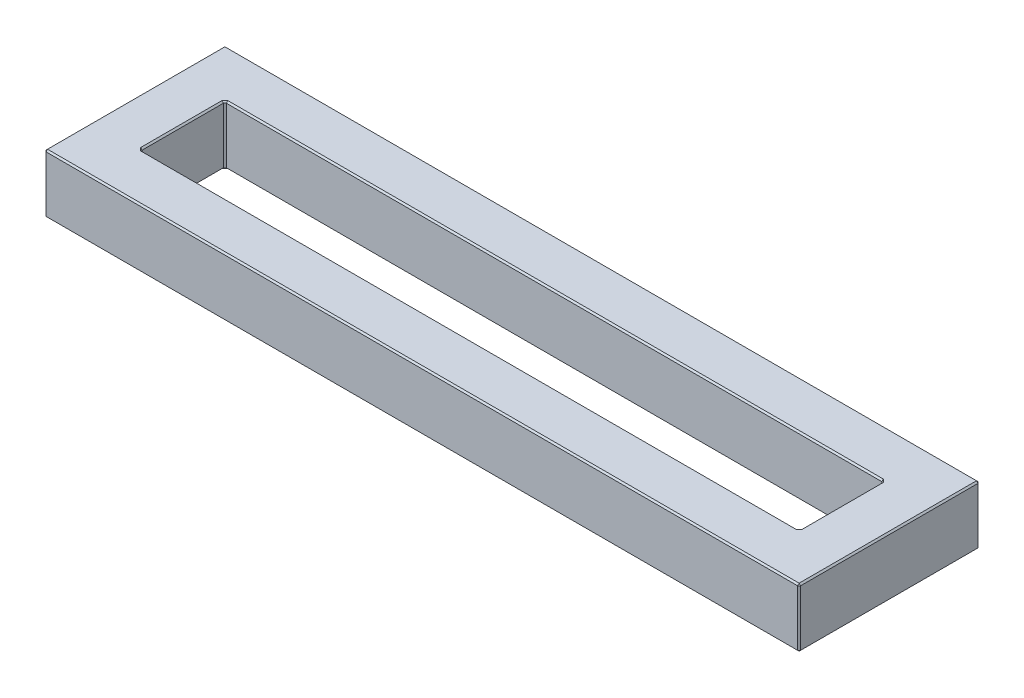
from build123d import *

# Parameters (mm, degrees)
SKETCH1_W           = 125.5
SKETCH1_H           = 30
SKETCH1_W_2         = 109.5
SKETCH1_H_2         = 14
BOSS_EXTRUDE1_DEPTH = 9.8
CHAMFER1_SIZE       = 0.25


with BuildPart() as part:
    # Sketch1 → Boss-Extrude1 (new body)
    with BuildSketch(Plane(origin=(0, 0, 0), x_dir=(1, 0, 0), z_dir=(0, 1, 0))):
        Rectangle(SKETCH1_W, SKETCH1_H)
        Rectangle(SKETCH1_W_2, SKETCH1_H_2, mode=Mode.SUBTRACT)
    extrude(amount=BOSS_EXTRUDE1_DEPTH)

    # Chamfer1
    chamfer1_edges = [part.edges().sort_by_distance(p)[0] for p in [
        (54.75, 0, 0),
        (0, 0, -7),
        (-54.75, 0, 0),
        (0, 0, 7),
        (0, 9.8, -15),
        (0, 0, 15),
        (-62.75, 0, 0),
        (0, 0, -15),
        (62.75, 0, 0),
        (54.75, 4.9, 7),
        (54.75, 4.9, -7),
        (-54.75, 4.9, -7),
        (-54.75, 4.9, 7),
        (62.75, 4.9, 15),
        (-62.75, 4.9, 15),
        (-62.75, 9.8, 0),
        (-62.75, 4.9, -15),
        (62.75, 4.9, -15),
        (0, 9.8, 15),
        (0, 9.8, 7),
        (-54.75, 9.8, 0),
        (0, 9.8, -7),
        (54.75, 9.8, 0),
        (62.75, 9.8, 0),
    ]]
    chamfer(chamfer1_edges, length=CHAMFER1_SIZE)


solid = part.part
